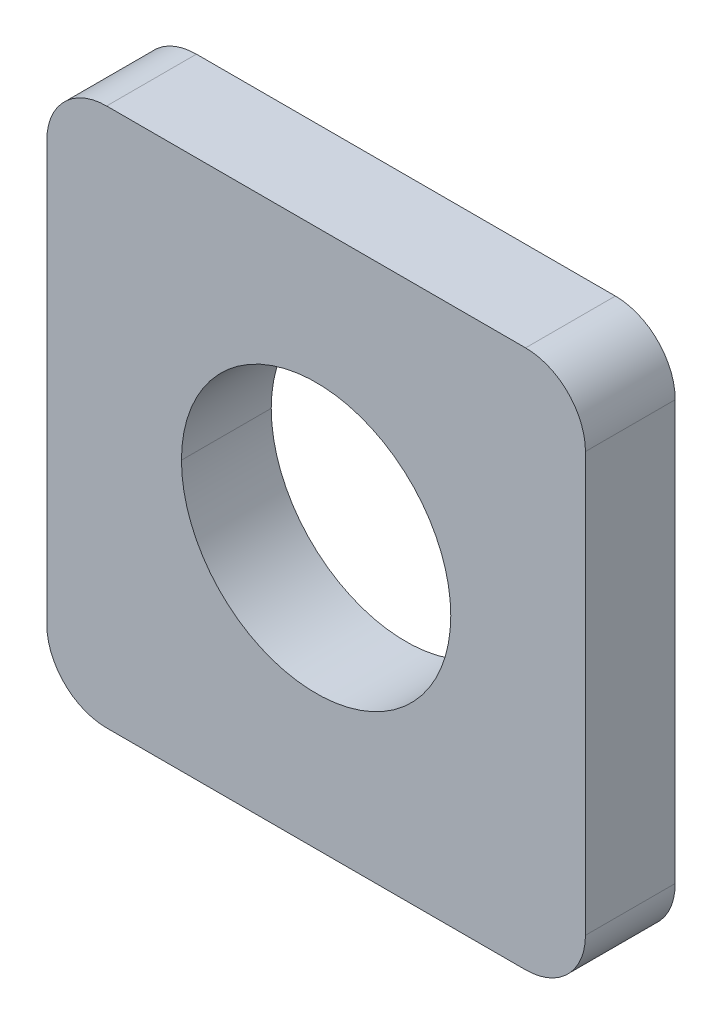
ISO-10303-21;
HEADER;
FILE_DESCRIPTION(('STEP AP214'),'2;1');
FILE_NAME('part.step','',(''),(''),'','','');
FILE_SCHEMA(('AUTOMOTIVE_DESIGN { 1 0 10303 214 1 1 1 1 }'));
ENDSEC;
DATA;
#1=APPLICATION_CONTEXT('core data for automotive mechanical design processes');
#2=APPLICATION_PROTOCOL_DEFINITION('international standard','automotive_design',2000,#1);
#3=PRODUCT_CONTEXT('',#1,'mechanical');
#4=PRODUCT('Part','Part','',(#3));
#5=PRODUCT_RELATED_PRODUCT_CATEGORY('part','',(#4));
#6=PRODUCT_DEFINITION_FORMATION('','',#4);
#7=PRODUCT_DEFINITION_CONTEXT('part definition',#1,'design');
#8=PRODUCT_DEFINITION('design','',#6,#7);
#9=PRODUCT_DEFINITION_SHAPE('','',#8);
#10=(LENGTH_UNIT() NAMED_UNIT(*) SI_UNIT(.MILLI.,.METRE.));
#11=(NAMED_UNIT(*) PLANE_ANGLE_UNIT() SI_UNIT($,.RADIAN.));
#12=(NAMED_UNIT(*) SI_UNIT($,.STERADIAN.) SOLID_ANGLE_UNIT());
#13=UNCERTAINTY_MEASURE_WITH_UNIT(LENGTH_MEASURE(1.E-05),#10,'distance_accuracy_value','');
#14=(GEOMETRIC_REPRESENTATION_CONTEXT(3) GLOBAL_UNCERTAINTY_ASSIGNED_CONTEXT((#13)) GLOBAL_UNIT_ASSIGNED_CONTEXT((#10,
#11,#12)) REPRESENTATION_CONTEXT('',''));
#15=CARTESIAN_POINT('',(0.,0.,0.));
#16=DIRECTION('',(0.,0.,1.));
#17=DIRECTION('',(1.,0.,0.));
#18=AXIS2_PLACEMENT_3D('',#15,#16,#17);
#19=CARTESIAN_POINT('',(-4.5,-4.5,0.));
#20=DIRECTION('',(0.,-1.,0.));
#21=DIRECTION('',(0.,0.,-1.));
#22=AXIS2_PLACEMENT_3D('',#19,#20,#21);
#23=PLANE('',#22);
#24=DIRECTION('',(1.,0.,0.));
#25=VECTOR('',#24,1.);
#26=CARTESIAN_POINT('',(-3.5,-4.5,0.));
#27=LINE('',#26,#25);
#28=CARTESIAN_POINT('',(-3.5,-4.5,0.));
#29=VERTEX_POINT('',#28);
#30=CARTESIAN_POINT('',(3.5,-4.5,0.));
#31=VERTEX_POINT('',#30);
#32=EDGE_CURVE('E141',#29,#31,#27,.T.);
#33=ORIENTED_EDGE('',*,*,#32,.T.);
#34=DIRECTION('',(0.,0.,-1.));
#35=VECTOR('',#34,1.);
#36=CARTESIAN_POINT('',(3.5,-4.5,1.5));
#37=LINE('',#36,#35);
#38=CARTESIAN_POINT('',(3.5,-4.5,1.5));
#39=VERTEX_POINT('',#38);
#40=EDGE_CURVE('E11',#39,#31,#37,.T.);
#41=ORIENTED_EDGE('',*,*,#40,.F.);
#42=DIRECTION('',(1.,0.,0.));
#43=VECTOR('',#42,1.);
#44=CARTESIAN_POINT('',(-3.5,-4.5,1.5));
#45=LINE('',#44,#43);
#46=CARTESIAN_POINT('',(-3.5,-4.5,1.5));
#47=VERTEX_POINT('',#46);
#48=EDGE_CURVE('E168',#47,#39,#45,.T.);
#49=ORIENTED_EDGE('',*,*,#48,.F.);
#50=DIRECTION('',(0.,0.,-1.));
#51=VECTOR('',#50,1.);
#52=CARTESIAN_POINT('',(-3.5,-4.5,1.5));
#53=LINE('',#52,#51);
#54=EDGE_CURVE('E222',#47,#29,#53,.T.);
#55=ORIENTED_EDGE('',*,*,#54,.T.);
#56=EDGE_LOOP('',(#33,#41,#49,#55));
#57=FACE_BOUND('',#56,.T.);
#58=ADVANCED_FACE('F17',(#57),#23,.T.);
#59=CARTESIAN_POINT('',(3.5,-3.5,3.4554));
#60=DIRECTION('',(0.,0.,-1.));
#61=DIRECTION('',(1.,0.,0.));
#62=AXIS2_PLACEMENT_3D('',#59,#60,#61);
#63=CYLINDRICAL_SURFACE('',#62,1.);
#64=DIRECTION('',(0.,0.,-1.));
#65=VECTOR('',#64,1.);
#66=CARTESIAN_POINT('',(4.5,-3.5,1.5));
#67=LINE('',#66,#65);
#68=CARTESIAN_POINT('',(4.5,-3.5,1.5));
#69=VERTEX_POINT('',#68);
#70=CARTESIAN_POINT('',(4.5,-3.5,0.));
#71=VERTEX_POINT('',#70);
#72=EDGE_CURVE('E26',#69,#71,#67,.T.);
#73=ORIENTED_EDGE('',*,*,#72,.F.);
#74=CARTESIAN_POINT('',(3.5,-3.5,1.5));
#75=DIRECTION('',(0.,0.,1.));
#76=DIRECTION('',(0.,-1.,0.));
#77=AXIS2_PLACEMENT_3D('',#74,#75,#76);
#78=CIRCLE('',#77,1.);
#79=EDGE_CURVE('E165',#39,#69,#78,.T.);
#80=ORIENTED_EDGE('',*,*,#79,.F.);
#81=ORIENTED_EDGE('',*,*,#40,.T.);
#82=CARTESIAN_POINT('',(3.5,-3.5,0.));
#83=DIRECTION('',(0.,0.,-1.));
#84=DIRECTION('',(1.,0.,0.));
#85=AXIS2_PLACEMENT_3D('',#82,#83,#84);
#86=CIRCLE('',#85,1.);
#87=EDGE_CURVE('E135',#71,#31,#86,.T.);
#88=ORIENTED_EDGE('',*,*,#87,.F.);
#89=EDGE_LOOP('',(#73,#80,#81,#88));
#90=FACE_BOUND('',#89,.T.);
#91=ADVANCED_FACE('F136',(#90),#63,.T.);
#92=CARTESIAN_POINT('',(4.5,-4.5,0.));
#93=DIRECTION('',(1.,0.,0.));
#94=DIRECTION('',(0.,1.,0.));
#95=AXIS2_PLACEMENT_3D('',#92,#93,#94);
#96=PLANE('',#95);
#97=DIRECTION('',(0.,1.,0.));
#98=VECTOR('',#97,1.);
#99=CARTESIAN_POINT('',(4.5,-3.5,0.));
#100=LINE('',#99,#98);
#101=CARTESIAN_POINT('',(4.5,3.5,0.));
#102=VERTEX_POINT('',#101);
#103=EDGE_CURVE('E124',#71,#102,#100,.T.);
#104=ORIENTED_EDGE('',*,*,#103,.T.);
#105=DIRECTION('',(0.,0.,-1.));
#106=VECTOR('',#105,1.);
#107=CARTESIAN_POINT('',(4.5,3.5,1.5));
#108=LINE('',#107,#106);
#109=CARTESIAN_POINT('',(4.5,3.5,1.5));
#110=VERTEX_POINT('',#109);
#111=EDGE_CURVE('E132',#110,#102,#108,.T.);
#112=ORIENTED_EDGE('',*,*,#111,.F.);
#113=DIRECTION('',(0.,1.,0.));
#114=VECTOR('',#113,1.);
#115=CARTESIAN_POINT('',(4.5,-3.5,1.5));
#116=LINE('',#115,#114);
#117=EDGE_CURVE('E127',#69,#110,#116,.T.);
#118=ORIENTED_EDGE('',*,*,#117,.F.);
#119=ORIENTED_EDGE('',*,*,#72,.T.);
#120=EDGE_LOOP('',(#104,#112,#118,#119));
#121=FACE_BOUND('',#120,.T.);
#122=ADVANCED_FACE('F122',(#121),#96,.T.);
#123=CARTESIAN_POINT('',(3.5,3.5,3.4554));
#124=DIRECTION('',(0.,0.,-1.));
#125=DIRECTION('',(0.,1.,0.));
#126=AXIS2_PLACEMENT_3D('',#123,#124,#125);
#127=CYLINDRICAL_SURFACE('',#126,1.);
#128=DIRECTION('',(0.,0.,-1.));
#129=VECTOR('',#128,1.);
#130=CARTESIAN_POINT('',(3.5,4.5,1.5));
#131=LINE('',#130,#129);
#132=CARTESIAN_POINT('',(3.5,4.5,1.5));
#133=VERTEX_POINT('',#132);
#134=CARTESIAN_POINT('',(3.5,4.5,0.));
#135=VERTEX_POINT('',#134);
#136=EDGE_CURVE('E232',#133,#135,#131,.T.);
#137=ORIENTED_EDGE('',*,*,#136,.F.);
#138=CARTESIAN_POINT('',(3.5,3.5,1.5));
#139=DIRECTION('',(0.,0.,1.));
#140=DIRECTION('',(1.,0.,0.));
#141=AXIS2_PLACEMENT_3D('',#138,#139,#140);
#142=CIRCLE('',#141,1.);
#143=EDGE_CURVE('E202',#110,#133,#142,.T.);
#144=ORIENTED_EDGE('',*,*,#143,.F.);
#145=ORIENTED_EDGE('',*,*,#111,.T.);
#146=CARTESIAN_POINT('',(3.5,3.5,0.));
#147=DIRECTION('',(0.,0.,-1.));
#148=DIRECTION('',(0.,1.,0.));
#149=AXIS2_PLACEMENT_3D('',#146,#147,#148);
#150=CIRCLE('',#149,1.);
#151=EDGE_CURVE('E147',#135,#102,#150,.T.);
#152=ORIENTED_EDGE('',*,*,#151,.F.);
#153=EDGE_LOOP('',(#137,#144,#145,#152));
#154=FACE_BOUND('',#153,.T.);
#155=ADVANCED_FACE('F19',(#154),#127,.T.);
#156=CARTESIAN_POINT('',(4.5,4.5,0.));
#157=DIRECTION('',(0.,1.,0.));
#158=DIRECTION('',(1.,0.,0.));
#159=AXIS2_PLACEMENT_3D('',#156,#157,#158);
#160=PLANE('',#159);
#161=DIRECTION('',(-1.,0.,0.));
#162=VECTOR('',#161,1.);
#163=CARTESIAN_POINT('',(3.5,4.5,0.));
#164=LINE('',#163,#162);
#165=CARTESIAN_POINT('',(-3.5,4.5,0.));
#166=VERTEX_POINT('',#165);
#167=EDGE_CURVE('E154',#135,#166,#164,.T.);
#168=ORIENTED_EDGE('',*,*,#167,.T.);
#169=DIRECTION('',(0.,0.,-1.));
#170=VECTOR('',#169,1.);
#171=CARTESIAN_POINT('',(-3.5,4.5,1.5));
#172=LINE('',#171,#170);
#173=CARTESIAN_POINT('',(-3.5,4.5,1.5));
#174=VERTEX_POINT('',#173);
#175=EDGE_CURVE('E229',#174,#166,#172,.T.);
#176=ORIENTED_EDGE('',*,*,#175,.F.);
#177=DIRECTION('',(-1.,0.,0.));
#178=VECTOR('',#177,1.);
#179=CARTESIAN_POINT('',(3.5,4.5,1.5));
#180=LINE('',#179,#178);
#181=EDGE_CURVE('E206',#133,#174,#180,.T.);
#182=ORIENTED_EDGE('',*,*,#181,.F.);
#183=ORIENTED_EDGE('',*,*,#136,.T.);
#184=EDGE_LOOP('',(#168,#176,#182,#183));
#185=FACE_BOUND('',#184,.T.);
#186=ADVANCED_FACE('F248',(#185),#160,.T.);
#187=CARTESIAN_POINT('',(-3.5,3.5,3.4554));
#188=DIRECTION('',(0.,0.,-1.));
#189=DIRECTION('',(-1.,0.,0.));
#190=AXIS2_PLACEMENT_3D('',#187,#188,#189);
#191=CYLINDRICAL_SURFACE('',#190,1.);
#192=DIRECTION('',(0.,0.,-1.));
#193=VECTOR('',#192,1.);
#194=CARTESIAN_POINT('',(-4.5,3.5,1.5));
#195=LINE('',#194,#193);
#196=CARTESIAN_POINT('',(-4.5,3.5,1.5));
#197=VERTEX_POINT('',#196);
#198=CARTESIAN_POINT('',(-4.5,3.5,0.));
#199=VERTEX_POINT('',#198);
#200=EDGE_CURVE('E48',#197,#199,#195,.T.);
#201=ORIENTED_EDGE('',*,*,#200,.F.);
#202=CARTESIAN_POINT('',(-3.5,3.5,1.5));
#203=DIRECTION('',(0.,0.,1.));
#204=DIRECTION('',(0.,1.,0.));
#205=AXIS2_PLACEMENT_3D('',#202,#203,#204);
#206=CIRCLE('',#205,1.);
#207=EDGE_CURVE('E210',#174,#197,#206,.T.);
#208=ORIENTED_EDGE('',*,*,#207,.F.);
#209=ORIENTED_EDGE('',*,*,#175,.T.);
#210=CARTESIAN_POINT('',(-3.5,3.5,0.));
#211=DIRECTION('',(0.,0.,-1.));
#212=DIRECTION('',(-1.,0.,0.));
#213=AXIS2_PLACEMENT_3D('',#210,#211,#212);
#214=CIRCLE('',#213,1.);
#215=EDGE_CURVE('E161',#199,#166,#214,.T.);
#216=ORIENTED_EDGE('',*,*,#215,.F.);
#217=EDGE_LOOP('',(#201,#208,#209,#216));
#218=FACE_BOUND('',#217,.T.);
#219=ADVANCED_FACE('F246',(#218),#191,.T.);
#220=CARTESIAN_POINT('',(-4.5,4.5,0.));
#221=DIRECTION('',(-1.,0.,0.));
#222=DIRECTION('',(0.,0.,1.));
#223=AXIS2_PLACEMENT_3D('',#220,#221,#222);
#224=PLANE('',#223);
#225=DIRECTION('',(0.,-1.,0.));
#226=VECTOR('',#225,1.);
#227=CARTESIAN_POINT('',(-4.5,3.5,1.5));
#228=LINE('',#227,#226);
#229=CARTESIAN_POINT('',(-4.5,-3.5,1.5));
#230=VERTEX_POINT('',#229);
#231=EDGE_CURVE('E214',#197,#230,#228,.T.);
#232=ORIENTED_EDGE('',*,*,#231,.F.);
#233=ORIENTED_EDGE('',*,*,#200,.T.);
#234=DIRECTION('',(0.,-1.,0.));
#235=VECTOR('',#234,1.);
#236=CARTESIAN_POINT('',(-4.5,3.5,0.));
#237=LINE('',#236,#235);
#238=CARTESIAN_POINT('',(-4.5,-3.5,0.));
#239=VERTEX_POINT('',#238);
#240=EDGE_CURVE('E159',#199,#239,#237,.T.);
#241=ORIENTED_EDGE('',*,*,#240,.T.);
#242=DIRECTION('',(0.,0.,-1.));
#243=VECTOR('',#242,1.);
#244=CARTESIAN_POINT('',(-4.5,-3.5,1.5));
#245=LINE('',#244,#243);
#246=EDGE_CURVE('E38',#230,#239,#245,.T.);
#247=ORIENTED_EDGE('',*,*,#246,.F.);
#248=EDGE_LOOP('',(#232,#233,#241,#247));
#249=FACE_BOUND('',#248,.T.);
#250=ADVANCED_FACE('F245',(#249),#224,.T.);
#251=CARTESIAN_POINT('',(-3.5,-3.5,3.4554));
#252=DIRECTION('',(0.,0.,-1.));
#253=DIRECTION('',(0.,-1.,0.));
#254=AXIS2_PLACEMENT_3D('',#251,#252,#253);
#255=CYLINDRICAL_SURFACE('',#254,1.);
#256=ORIENTED_EDGE('',*,*,#54,.F.);
#257=CARTESIAN_POINT('',(-3.5,-3.5,1.5));
#258=DIRECTION('',(0.,0.,1.));
#259=DIRECTION('',(-1.,0.,0.));
#260=AXIS2_PLACEMENT_3D('',#257,#258,#259);
#261=CIRCLE('',#260,1.);
#262=EDGE_CURVE('E218',#230,#47,#261,.T.);
#263=ORIENTED_EDGE('',*,*,#262,.F.);
#264=ORIENTED_EDGE('',*,*,#246,.T.);
#265=CARTESIAN_POINT('',(-3.5,-3.5,0.));
#266=DIRECTION('',(0.,0.,-1.));
#267=DIRECTION('',(0.,-1.,0.));
#268=AXIS2_PLACEMENT_3D('',#265,#266,#267);
#269=CIRCLE('',#268,1.);
#270=EDGE_CURVE('E184',#29,#239,#269,.T.);
#271=ORIENTED_EDGE('',*,*,#270,.F.);
#272=EDGE_LOOP('',(#256,#263,#264,#271));
#273=FACE_BOUND('',#272,.T.);
#274=ADVANCED_FACE('F266',(#273),#255,.T.);
#275=CARTESIAN_POINT('',(0.,0.,1.5));
#276=DIRECTION('',(0.,0.,1.));
#277=DIRECTION('',(1.,0.,0.));
#278=AXIS2_PLACEMENT_3D('',#275,#276,#277);
#279=PLANE('',#278);
#280=CARTESIAN_POINT('',(0.,0.,1.5));
#281=DIRECTION('',(0.,0.,-1.));
#282=DIRECTION('',(-1.,0.,0.));
#283=AXIS2_PLACEMENT_3D('',#280,#281,#282);
#284=CIRCLE('',#283,2.25);
#285=CARTESIAN_POINT('',(-2.25,0.,1.5));
#286=VERTEX_POINT('',#285);
#287=CARTESIAN_POINT('',(2.25,0.,1.5));
#288=VERTEX_POINT('',#287);
#289=EDGE_CURVE('E178',#286,#288,#284,.T.);
#290=ORIENTED_EDGE('',*,*,#289,.T.);
#291=CARTESIAN_POINT('',(0.,0.,1.5));
#292=DIRECTION('',(0.,0.,-1.));
#293=DIRECTION('',(1.,0.,0.));
#294=AXIS2_PLACEMENT_3D('',#291,#292,#293);
#295=CIRCLE('',#294,2.25);
#296=EDGE_CURVE('E158',#288,#286,#295,.T.);
#297=ORIENTED_EDGE('',*,*,#296,.T.);
#298=EDGE_LOOP('',(#290,#297));
#299=FACE_BOUND('',#298,.T.);
#300=ORIENTED_EDGE('',*,*,#48,.T.);
#301=ORIENTED_EDGE('',*,*,#79,.T.);
#302=ORIENTED_EDGE('',*,*,#117,.T.);
#303=ORIENTED_EDGE('',*,*,#143,.T.);
#304=ORIENTED_EDGE('',*,*,#181,.T.);
#305=ORIENTED_EDGE('',*,*,#207,.T.);
#306=ORIENTED_EDGE('',*,*,#231,.T.);
#307=ORIENTED_EDGE('',*,*,#262,.T.);
#308=EDGE_LOOP('',(#300,#301,#302,#303,#304,#305,#306,#307));
#309=FACE_BOUND('',#308,.T.);
#310=ADVANCED_FACE('F240',(#299,#309),#279,.T.);
#311=CARTESIAN_POINT('',(0.,0.,0.));
#312=DIRECTION('',(0.,0.,1.));
#313=DIRECTION('',(1.,0.,0.));
#314=AXIS2_PLACEMENT_3D('',#311,#312,#313);
#315=CYLINDRICAL_SURFACE('',#314,2.25);
#316=DIRECTION('',(0.,0.,1.));
#317=VECTOR('',#316,1.);
#318=CARTESIAN_POINT('',(2.25,0.,0.));
#319=LINE('',#318,#317);
#320=CARTESIAN_POINT('',(2.25,0.,0.));
#321=VERTEX_POINT('',#320);
#322=EDGE_CURVE('E180',#321,#288,#319,.T.);
#323=ORIENTED_EDGE('',*,*,#322,.T.);
#324=ORIENTED_EDGE('',*,*,#289,.F.);
#325=DIRECTION('',(0.,0.,1.));
#326=VECTOR('',#325,1.);
#327=CARTESIAN_POINT('',(-2.25,0.,0.));
#328=LINE('',#327,#326);
#329=CARTESIAN_POINT('',(-2.25,0.,0.));
#330=VERTEX_POINT('',#329);
#331=EDGE_CURVE('E176',#330,#286,#328,.T.);
#332=ORIENTED_EDGE('',*,*,#331,.F.);
#333=CARTESIAN_POINT('',(0.,0.,0.));
#334=DIRECTION('',(0.,0.,-1.));
#335=DIRECTION('',(-1.,0.,0.));
#336=AXIS2_PLACEMENT_3D('',#333,#334,#335);
#337=CIRCLE('',#336,2.25);
#338=EDGE_CURVE('E177',#330,#321,#337,.T.);
#339=ORIENTED_EDGE('',*,*,#338,.T.);
#340=EDGE_LOOP('',(#323,#324,#332,#339));
#341=FACE_BOUND('',#340,.T.);
#342=ADVANCED_FACE('F277',(#341),#315,.F.);
#343=CARTESIAN_POINT('',(0.,0.,0.));
#344=DIRECTION('',(0.,0.,1.));
#345=DIRECTION('',(1.,0.,0.));
#346=AXIS2_PLACEMENT_3D('',#343,#344,#345);
#347=CYLINDRICAL_SURFACE('',#346,2.25);
#348=ORIENTED_EDGE('',*,*,#331,.T.);
#349=ORIENTED_EDGE('',*,*,#296,.F.);
#350=ORIENTED_EDGE('',*,*,#322,.F.);
#351=CARTESIAN_POINT('',(0.,0.,0.));
#352=DIRECTION('',(0.,0.,-1.));
#353=DIRECTION('',(1.,0.,0.));
#354=AXIS2_PLACEMENT_3D('',#351,#352,#353);
#355=CIRCLE('',#354,2.25);
#356=EDGE_CURVE('E172',#321,#330,#355,.T.);
#357=ORIENTED_EDGE('',*,*,#356,.T.);
#358=EDGE_LOOP('',(#348,#349,#350,#357));
#359=FACE_BOUND('',#358,.T.);
#360=ADVANCED_FACE('F283',(#359),#347,.F.);
#361=CARTESIAN_POINT('',(0.,0.,0.));
#362=DIRECTION('',(0.,0.,1.));
#363=DIRECTION('',(1.,0.,0.));
#364=AXIS2_PLACEMENT_3D('',#361,#362,#363);
#365=PLANE('',#364);
#366=ORIENTED_EDGE('',*,*,#338,.F.);
#367=ORIENTED_EDGE('',*,*,#356,.F.);
#368=EDGE_LOOP('',(#366,#367));
#369=FACE_BOUND('',#368,.T.);
#370=ORIENTED_EDGE('',*,*,#240,.F.);
#371=ORIENTED_EDGE('',*,*,#215,.T.);
#372=ORIENTED_EDGE('',*,*,#167,.F.);
#373=ORIENTED_EDGE('',*,*,#151,.T.);
#374=ORIENTED_EDGE('',*,*,#103,.F.);
#375=ORIENTED_EDGE('',*,*,#87,.T.);
#376=ORIENTED_EDGE('',*,*,#32,.F.);
#377=ORIENTED_EDGE('',*,*,#270,.T.);
#378=EDGE_LOOP('',(#370,#371,#372,#373,#374,#375,#376,#377));
#379=FACE_BOUND('',#378,.T.);
#380=ADVANCED_FACE('F144',(#369,#379),#365,.F.);
#381=CLOSED_SHELL('',(#58,#91,#122,#155,#186,#219,#250,#274,#310,#342,#360,#380));
#382=MANIFOLD_SOLID_BREP('B1',#381);
#383=ADVANCED_BREP_SHAPE_REPRESENTATION('',(#18,#382),#14);
#384=SHAPE_DEFINITION_REPRESENTATION(#9,#383);
ENDSEC;
END-ISO-10303-21;
